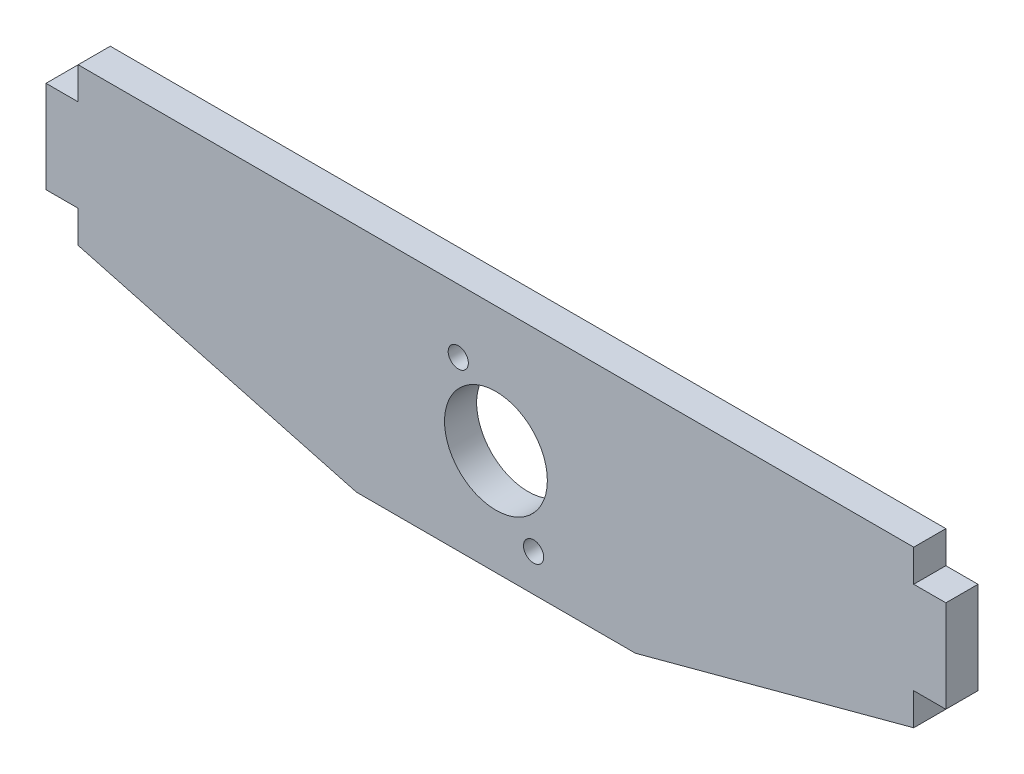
ISO-10303-21;
HEADER;
FILE_DESCRIPTION(('STEP AP214'),'2;1');
FILE_NAME('part.step','',(''),(''),'','','');
FILE_SCHEMA(('AUTOMOTIVE_DESIGN { 1 0 10303 214 1 1 1 1 }'));
ENDSEC;
DATA;
#1=APPLICATION_CONTEXT('core data for automotive mechanical design processes');
#2=APPLICATION_PROTOCOL_DEFINITION('international standard','automotive_design',2000,#1);
#3=PRODUCT_CONTEXT('',#1,'mechanical');
#4=PRODUCT('Part','Part','',(#3));
#5=PRODUCT_RELATED_PRODUCT_CATEGORY('part','',(#4));
#6=PRODUCT_DEFINITION_FORMATION('','',#4);
#7=PRODUCT_DEFINITION_CONTEXT('part definition',#1,'design');
#8=PRODUCT_DEFINITION('design','',#6,#7);
#9=PRODUCT_DEFINITION_SHAPE('','',#8);
#10=(LENGTH_UNIT() NAMED_UNIT(*) SI_UNIT(.MILLI.,.METRE.));
#11=(NAMED_UNIT(*) PLANE_ANGLE_UNIT() SI_UNIT($,.RADIAN.));
#12=(NAMED_UNIT(*) SI_UNIT($,.STERADIAN.) SOLID_ANGLE_UNIT());
#13=UNCERTAINTY_MEASURE_WITH_UNIT(LENGTH_MEASURE(1.E-05),#10,'distance_accuracy_value','');
#14=(GEOMETRIC_REPRESENTATION_CONTEXT(3) GLOBAL_UNCERTAINTY_ASSIGNED_CONTEXT((#13)) GLOBAL_UNIT_ASSIGNED_CONTEXT((#10,
#11,#12)) REPRESENTATION_CONTEXT('',''));
#15=CARTESIAN_POINT('',(0.,0.,0.));
#16=DIRECTION('',(0.,0.,1.));
#17=DIRECTION('',(1.,0.,0.));
#18=AXIS2_PLACEMENT_3D('',#15,#16,#17);
#19=CARTESIAN_POINT('',(44.45,12.7,1.5875));
#20=DIRECTION('',(-1.,0.,0.));
#21=DIRECTION('',(0.,0.,1.));
#22=AXIS2_PLACEMENT_3D('',#19,#20,#21);
#23=PLANE('',#22);
#24=DIRECTION('',(0.,1.,0.));
#25=VECTOR('',#24,1.);
#26=CARTESIAN_POINT('',(44.45,12.7,1.5875));
#27=LINE('',#26,#25);
#28=CARTESIAN_POINT('',(44.45,0.419261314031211,1.5875));
#29=VERTEX_POINT('',#28);
#30=CARTESIAN_POINT('',(44.45,9.52500000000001,1.5875));
#31=VERTEX_POINT('',#30);
#32=EDGE_CURVE('E251',#29,#31,#27,.T.);
#33=ORIENTED_EDGE('',*,*,#32,.F.);
#34=DIRECTION('',(0.,0.,1.));
#35=VECTOR('',#34,1.);
#36=CARTESIAN_POINT('',(44.45,0.419261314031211,-1.5875));
#37=LINE('',#36,#35);
#38=CARTESIAN_POINT('',(44.45,0.419261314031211,-1.5875));
#39=VERTEX_POINT('',#38);
#40=EDGE_CURVE('E156',#39,#29,#37,.T.);
#41=ORIENTED_EDGE('',*,*,#40,.F.);
#42=DIRECTION('',(0.,1.,0.));
#43=VECTOR('',#42,1.);
#44=CARTESIAN_POINT('',(44.45,12.7,-1.5875));
#45=LINE('',#44,#43);
#46=CARTESIAN_POINT('',(44.45,9.52500000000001,-1.5875));
#47=VERTEX_POINT('',#46);
#48=EDGE_CURVE('E151',#39,#47,#45,.T.);
#49=ORIENTED_EDGE('',*,*,#48,.T.);
#50=DIRECTION('',(0.,0.,1.));
#51=VECTOR('',#50,1.);
#52=CARTESIAN_POINT('',(44.45,9.52500000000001,-1.5875));
#53=LINE('',#52,#51);
#54=EDGE_CURVE('E226',#47,#31,#53,.T.);
#55=ORIENTED_EDGE('',*,*,#54,.T.);
#56=EDGE_LOOP('',(#33,#41,#49,#55));
#57=FACE_BOUND('',#56,.T.);
#58=ADVANCED_FACE('F31',(#57),#23,.F.);
#59=CARTESIAN_POINT('',(-44.45,12.7,1.5875));
#60=DIRECTION('',(0.,-1.,0.));
#61=DIRECTION('',(0.,0.,-1.));
#62=AXIS2_PLACEMENT_3D('',#59,#60,#61);
#63=PLANE('',#62);
#64=DIRECTION('',(-1.,0.,0.));
#65=VECTOR('',#64,1.);
#66=CARTESIAN_POINT('',(-44.45,12.7,1.5875));
#67=LINE('',#66,#65);
#68=CARTESIAN_POINT('',(41.275,12.7,1.5875));
#69=VERTEX_POINT('',#68);
#70=CARTESIAN_POINT('',(-41.275,12.7,1.5875));
#71=VERTEX_POINT('',#70);
#72=EDGE_CURVE('E39',#69,#71,#67,.T.);
#73=ORIENTED_EDGE('',*,*,#72,.F.);
#74=DIRECTION('',(0.,0.,1.));
#75=VECTOR('',#74,1.);
#76=CARTESIAN_POINT('',(41.275,12.7,-1.5875));
#77=LINE('',#76,#75);
#78=CARTESIAN_POINT('',(41.275,12.7,-1.5875));
#79=VERTEX_POINT('',#78);
#80=EDGE_CURVE('E221',#79,#69,#77,.T.);
#81=ORIENTED_EDGE('',*,*,#80,.F.);
#82=DIRECTION('',(-1.,0.,0.));
#83=VECTOR('',#82,1.);
#84=CARTESIAN_POINT('',(-44.45,12.7,-1.5875));
#85=LINE('',#84,#83);
#86=CARTESIAN_POINT('',(-41.275,12.7,-1.5875));
#87=VERTEX_POINT('',#86);
#88=EDGE_CURVE('E254',#79,#87,#85,.T.);
#89=ORIENTED_EDGE('',*,*,#88,.T.);
#90=DIRECTION('',(0.,0.,1.));
#91=VECTOR('',#90,1.);
#92=CARTESIAN_POINT('',(-41.275,12.7,-1.5875));
#93=LINE('',#92,#91);
#94=EDGE_CURVE('E245',#87,#71,#93,.T.);
#95=ORIENTED_EDGE('',*,*,#94,.T.);
#96=EDGE_LOOP('',(#73,#81,#89,#95));
#97=FACE_BOUND('',#96,.T.);
#98=ADVANCED_FACE('F286',(#97),#63,.F.);
#99=CARTESIAN_POINT('',(-44.45,12.7,1.5875));
#100=DIRECTION('',(1.,0.,0.));
#101=DIRECTION('',(0.,0.,-1.));
#102=AXIS2_PLACEMENT_3D('',#99,#100,#101);
#103=PLANE('',#102);
#104=DIRECTION('',(0.,-1.,0.));
#105=VECTOR('',#104,1.);
#106=CARTESIAN_POINT('',(-44.45,12.7,-1.5875));
#107=LINE('',#106,#105);
#108=CARTESIAN_POINT('',(-44.45,9.525,-1.5875));
#109=VERTEX_POINT('',#108);
#110=CARTESIAN_POINT('',(-44.45,0.4192613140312,-1.5875));
#111=VERTEX_POINT('',#110);
#112=EDGE_CURVE('E34',#109,#111,#107,.T.);
#113=ORIENTED_EDGE('',*,*,#112,.T.);
#114=DIRECTION('',(0.,0.,1.));
#115=VECTOR('',#114,1.);
#116=CARTESIAN_POINT('',(-44.45,0.4192613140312,-1.5875));
#117=LINE('',#116,#115);
#118=CARTESIAN_POINT('',(-44.45,0.4192613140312,1.5875));
#119=VERTEX_POINT('',#118);
#120=EDGE_CURVE('E169',#111,#119,#117,.T.);
#121=ORIENTED_EDGE('',*,*,#120,.T.);
#122=DIRECTION('',(0.,-1.,0.));
#123=VECTOR('',#122,1.);
#124=CARTESIAN_POINT('',(-44.45,12.7,1.5875));
#125=LINE('',#124,#123);
#126=CARTESIAN_POINT('',(-44.45,9.525,1.5875));
#127=VERTEX_POINT('',#126);
#128=EDGE_CURVE('E11',#127,#119,#125,.T.);
#129=ORIENTED_EDGE('',*,*,#128,.F.);
#130=DIRECTION('',(0.,0.,1.));
#131=VECTOR('',#130,1.);
#132=CARTESIAN_POINT('',(-44.45,9.525,-1.5875));
#133=LINE('',#132,#131);
#134=EDGE_CURVE('E240',#109,#127,#133,.T.);
#135=ORIENTED_EDGE('',*,*,#134,.F.);
#136=EDGE_LOOP('',(#113,#121,#129,#135));
#137=FACE_BOUND('',#136,.T.);
#138=ADVANCED_FACE('F263',(#137),#103,.F.);
#139=CARTESIAN_POINT('',(44.45,-12.7,1.5875));
#140=DIRECTION('',(0.,0.,1.));
#141=DIRECTION('',(1.,0.,0.));
#142=AXIS2_PLACEMENT_3D('',#139,#140,#141);
#143=PLANE('',#142);
#144=DIRECTION('',(-1.,0.,0.));
#145=VECTOR('',#144,1.);
#146=CARTESIAN_POINT('',(41.275,0.419261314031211,1.5875));
#147=LINE('',#146,#145);
#148=CARTESIAN_POINT('',(41.275,0.419261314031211,1.5875));
#149=VERTEX_POINT('',#148);
#150=EDGE_CURVE('E139',#29,#149,#147,.T.);
#151=ORIENTED_EDGE('',*,*,#150,.F.);
#152=ORIENTED_EDGE('',*,*,#32,.T.);
#153=DIRECTION('',(1.,0.,0.));
#154=VECTOR('',#153,1.);
#155=CARTESIAN_POINT('',(44.45,9.52500000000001,1.5875));
#156=LINE('',#155,#154);
#157=CARTESIAN_POINT('',(41.275,9.52500000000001,1.5875));
#158=VERTEX_POINT('',#157);
#159=EDGE_CURVE('E219',#158,#31,#156,.T.);
#160=ORIENTED_EDGE('',*,*,#159,.F.);
#161=DIRECTION('',(0.,-1.,0.));
#162=VECTOR('',#161,1.);
#163=CARTESIAN_POINT('',(41.275,12.7,1.5875));
#164=LINE('',#163,#162);
#165=EDGE_CURVE('E212',#69,#158,#164,.T.);
#166=ORIENTED_EDGE('',*,*,#165,.F.);
#167=ORIENTED_EDGE('',*,*,#72,.T.);
#168=DIRECTION('',(0.,1.,0.));
#169=VECTOR('',#168,1.);
#170=CARTESIAN_POINT('',(-41.275,12.7,1.5875));
#171=LINE('',#170,#169);
#172=CARTESIAN_POINT('',(-41.275,9.525,1.5875));
#173=VERTEX_POINT('',#172);
#174=EDGE_CURVE('E237',#173,#71,#171,.T.);
#175=ORIENTED_EDGE('',*,*,#174,.F.);
#176=DIRECTION('',(1.,0.,0.));
#177=VECTOR('',#176,1.);
#178=CARTESIAN_POINT('',(-44.45,9.525,1.5875));
#179=LINE('',#178,#177);
#180=EDGE_CURVE('E229',#127,#173,#179,.T.);
#181=ORIENTED_EDGE('',*,*,#180,.F.);
#182=ORIENTED_EDGE('',*,*,#128,.T.);
#183=DIRECTION('',(-1.,0.,0.));
#184=VECTOR('',#183,1.);
#185=CARTESIAN_POINT('',(-41.275,0.419261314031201,1.5875));
#186=LINE('',#185,#184);
#187=CARTESIAN_POINT('',(-41.275,0.419261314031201,1.5875));
#188=VERTEX_POINT('',#187);
#189=EDGE_CURVE('E162',#188,#119,#186,.T.);
#190=ORIENTED_EDGE('',*,*,#189,.F.);
#191=DIRECTION('',(0.,1.,0.));
#192=VECTOR('',#191,1.);
#193=CARTESIAN_POINT('',(-41.275,-2.7557386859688,1.5875));
#194=LINE('',#193,#192);
#195=CARTESIAN_POINT('',(-41.275,-2.7557386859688,1.5875));
#196=VERTEX_POINT('',#195);
#197=EDGE_CURVE('E158',#196,#188,#194,.T.);
#198=ORIENTED_EDGE('',*,*,#197,.F.);
#199=DIRECTION('',(-0.96592582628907,0.258819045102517,0.));
#200=VECTOR('',#199,1.);
#201=CARTESIAN_POINT('',(-44.45,-1.905,1.5875));
#202=LINE('',#201,#200);
#203=CARTESIAN_POINT('',(-13.781855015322,-10.1225046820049,1.5875));
#204=VERTEX_POINT('',#203);
#205=EDGE_CURVE('E179',#204,#196,#202,.T.);
#206=ORIENTED_EDGE('',*,*,#205,.F.);
#207=DIRECTION('',(-1.,0.,0.));
#208=VECTOR('',#207,1.);
#209=CARTESIAN_POINT('',(-13.781855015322,-10.1225046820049,1.5875));
#210=LINE('',#209,#208);
#211=CARTESIAN_POINT('',(13.7818550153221,-10.1225046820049,1.5875));
#212=VERTEX_POINT('',#211);
#213=EDGE_CURVE('E187',#212,#204,#210,.T.);
#214=ORIENTED_EDGE('',*,*,#213,.F.);
#215=DIRECTION('',(-0.965925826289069,-0.258819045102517,0.));
#216=VECTOR('',#215,1.);
#217=CARTESIAN_POINT('',(44.45,-1.90499999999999,1.5875));
#218=LINE('',#217,#216);
#219=CARTESIAN_POINT('',(41.275,-2.75573868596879,1.5875));
#220=VERTEX_POINT('',#219);
#221=EDGE_CURVE('E172',#220,#212,#218,.T.);
#222=ORIENTED_EDGE('',*,*,#221,.F.);
#223=DIRECTION('',(0.,-1.,0.));
#224=VECTOR('',#223,1.);
#225=CARTESIAN_POINT('',(41.275,-2.7557386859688,1.5875));
#226=LINE('',#225,#224);
#227=EDGE_CURVE('E47',#149,#220,#226,.T.);
#228=ORIENTED_EDGE('',*,*,#227,.F.);
#229=EDGE_LOOP('',(#151,#152,#160,#166,#167,#175,#181,#182,#190,#198,#206,#214,#222,#228));
#230=FACE_BOUND('',#229,.T.);
#231=CARTESIAN_POINT('',(-3.72109999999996,6.44513426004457,1.5875));
#232=DIRECTION('',(0.,0.,1.));
#233=DIRECTION('',(1.,0.,0.));
#234=AXIS2_PLACEMENT_3D('',#231,#232,#233);
#235=CIRCLE('',#234,0.996949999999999);
#236=CARTESIAN_POINT('',(-2.72414999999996,6.44513426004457,1.5875));
#237=VERTEX_POINT('',#236);
#238=EDGE_CURVE('E194',#237,#237,#235,.T.);
#239=ORIENTED_EDGE('',*,*,#238,.F.);
#240=EDGE_LOOP('',(#239));
#241=FACE_BOUND('',#240,.T.);
#242=CARTESIAN_POINT('',(3.72109999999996,-6.44513426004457,1.5875));
#243=DIRECTION('',(0.,0.,1.));
#244=DIRECTION('',(1.,0.,0.));
#245=AXIS2_PLACEMENT_3D('',#242,#243,#244);
#246=CIRCLE('',#245,0.99695);
#247=CARTESIAN_POINT('',(4.71804999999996,-6.44513426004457,1.5875));
#248=VERTEX_POINT('',#247);
#249=EDGE_CURVE('E202',#248,#248,#246,.T.);
#250=ORIENTED_EDGE('',*,*,#249,.F.);
#251=EDGE_LOOP('',(#250));
#252=FACE_BOUND('',#251,.T.);
#253=CARTESIAN_POINT('',(0.,0.30480000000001,1.5875));
#254=DIRECTION('',(0.,0.,1.));
#255=DIRECTION('',(1.,0.,0.));
#256=AXIS2_PLACEMENT_3D('',#253,#254,#255);
#257=CIRCLE('',#256,5.08);
#258=CARTESIAN_POINT('',(5.08,0.30480000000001,1.5875));
#259=VERTEX_POINT('',#258);
#260=EDGE_CURVE('E208',#259,#259,#257,.T.);
#261=ORIENTED_EDGE('',*,*,#260,.F.);
#262=EDGE_LOOP('',(#261));
#263=FACE_BOUND('',#262,.T.);
#264=ADVANCED_FACE('F271',(#230,#241,#252,#263),#143,.T.);
#265=CARTESIAN_POINT('',(44.45,-12.7,-1.5875));
#266=DIRECTION('',(0.,0.,1.));
#267=DIRECTION('',(1.,0.,0.));
#268=AXIS2_PLACEMENT_3D('',#265,#266,#267);
#269=PLANE('',#268);
#270=CARTESIAN_POINT('',(-3.72109999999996,6.44513426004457,-1.5875));
#271=DIRECTION('',(0.,0.,1.));
#272=DIRECTION('',(1.,0.,0.));
#273=AXIS2_PLACEMENT_3D('',#270,#271,#272);
#274=CIRCLE('',#273,0.996949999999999);
#275=CARTESIAN_POINT('',(-2.72414999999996,6.44513426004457,-1.5875));
#276=VERTEX_POINT('',#275);
#277=EDGE_CURVE('E199',#276,#276,#274,.T.);
#278=ORIENTED_EDGE('',*,*,#277,.T.);
#279=EDGE_LOOP('',(#278));
#280=FACE_BOUND('',#279,.T.);
#281=CARTESIAN_POINT('',(3.72109999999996,-6.44513426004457,-1.5875));
#282=DIRECTION('',(0.,0.,1.));
#283=DIRECTION('',(1.,0.,0.));
#284=AXIS2_PLACEMENT_3D('',#281,#282,#283);
#285=CIRCLE('',#284,0.996949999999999);
#286=CARTESIAN_POINT('',(4.71804999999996,-6.44513426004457,-1.5875));
#287=VERTEX_POINT('',#286);
#288=EDGE_CURVE('E205',#287,#287,#285,.T.);
#289=ORIENTED_EDGE('',*,*,#288,.T.);
#290=EDGE_LOOP('',(#289));
#291=FACE_BOUND('',#290,.T.);
#292=CARTESIAN_POINT('',(0.,0.30480000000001,-1.5875));
#293=DIRECTION('',(0.,0.,1.));
#294=DIRECTION('',(1.,0.,0.));
#295=AXIS2_PLACEMENT_3D('',#292,#293,#294);
#296=CIRCLE('',#295,5.08);
#297=CARTESIAN_POINT('',(5.08,0.30480000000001,-1.5875));
#298=VERTEX_POINT('',#297);
#299=EDGE_CURVE('E209',#298,#298,#296,.T.);
#300=ORIENTED_EDGE('',*,*,#299,.T.);
#301=EDGE_LOOP('',(#300));
#302=FACE_BOUND('',#301,.T.);
#303=ORIENTED_EDGE('',*,*,#48,.F.);
#304=DIRECTION('',(-1.,0.,0.));
#305=VECTOR('',#304,1.);
#306=CARTESIAN_POINT('',(41.275,0.419261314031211,-1.5875));
#307=LINE('',#306,#305);
#308=CARTESIAN_POINT('',(41.275,0.419261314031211,-1.5875));
#309=VERTEX_POINT('',#308);
#310=EDGE_CURVE('E136',#39,#309,#307,.T.);
#311=ORIENTED_EDGE('',*,*,#310,.T.);
#312=DIRECTION('',(0.,-1.,0.));
#313=VECTOR('',#312,1.);
#314=CARTESIAN_POINT('',(41.275,-2.7557386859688,-1.5875));
#315=LINE('',#314,#313);
#316=CARTESIAN_POINT('',(41.275,-2.7557386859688,-1.5875));
#317=VERTEX_POINT('',#316);
#318=EDGE_CURVE('E141',#309,#317,#315,.T.);
#319=ORIENTED_EDGE('',*,*,#318,.T.);
#320=DIRECTION('',(-0.965925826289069,-0.258819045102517,0.));
#321=VECTOR('',#320,1.);
#322=CARTESIAN_POINT('',(44.45,-1.90499999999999,-1.5875));
#323=LINE('',#322,#321);
#324=CARTESIAN_POINT('',(13.7818550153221,-10.1225046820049,-1.5875));
#325=VERTEX_POINT('',#324);
#326=EDGE_CURVE('E176',#317,#325,#323,.T.);
#327=ORIENTED_EDGE('',*,*,#326,.T.);
#328=DIRECTION('',(-1.,0.,0.));
#329=VECTOR('',#328,1.);
#330=CARTESIAN_POINT('',(-13.781855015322,-10.1225046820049,-1.5875));
#331=LINE('',#330,#329);
#332=CARTESIAN_POINT('',(-13.781855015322,-10.1225046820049,-1.5875));
#333=VERTEX_POINT('',#332);
#334=EDGE_CURVE('E178',#325,#333,#331,.T.);
#335=ORIENTED_EDGE('',*,*,#334,.T.);
#336=DIRECTION('',(-0.96592582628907,0.258819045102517,0.));
#337=VECTOR('',#336,1.);
#338=CARTESIAN_POINT('',(-44.45,-1.905,-1.5875));
#339=LINE('',#338,#337);
#340=CARTESIAN_POINT('',(-41.275,-2.7557386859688,-1.5875));
#341=VERTEX_POINT('',#340);
#342=EDGE_CURVE('E182',#333,#341,#339,.T.);
#343=ORIENTED_EDGE('',*,*,#342,.T.);
#344=DIRECTION('',(0.,1.,0.));
#345=VECTOR('',#344,1.);
#346=CARTESIAN_POINT('',(-41.275,-2.7557386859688,-1.5875));
#347=LINE('',#346,#345);
#348=CARTESIAN_POINT('',(-41.275,0.419261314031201,-1.5875));
#349=VERTEX_POINT('',#348);
#350=EDGE_CURVE('E55',#341,#349,#347,.T.);
#351=ORIENTED_EDGE('',*,*,#350,.T.);
#352=DIRECTION('',(-1.,0.,0.));
#353=VECTOR('',#352,1.);
#354=CARTESIAN_POINT('',(-41.275,0.419261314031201,-1.5875));
#355=LINE('',#354,#353);
#356=EDGE_CURVE('E161',#349,#111,#355,.T.);
#357=ORIENTED_EDGE('',*,*,#356,.T.);
#358=ORIENTED_EDGE('',*,*,#112,.F.);
#359=DIRECTION('',(1.,0.,0.));
#360=VECTOR('',#359,1.);
#361=CARTESIAN_POINT('',(-44.45,9.525,-1.5875));
#362=LINE('',#361,#360);
#363=CARTESIAN_POINT('',(-41.275,9.525,-1.5875));
#364=VERTEX_POINT('',#363);
#365=EDGE_CURVE('E233',#109,#364,#362,.T.);
#366=ORIENTED_EDGE('',*,*,#365,.T.);
#367=DIRECTION('',(0.,1.,0.));
#368=VECTOR('',#367,1.);
#369=CARTESIAN_POINT('',(-41.275,12.7,-1.5875));
#370=LINE('',#369,#368);
#371=EDGE_CURVE('E236',#364,#87,#370,.T.);
#372=ORIENTED_EDGE('',*,*,#371,.T.);
#373=ORIENTED_EDGE('',*,*,#88,.F.);
#374=DIRECTION('',(0.,-1.,0.));
#375=VECTOR('',#374,1.);
#376=CARTESIAN_POINT('',(41.275,12.7,-1.5875));
#377=LINE('',#376,#375);
#378=CARTESIAN_POINT('',(41.275,9.52500000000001,-1.5875));
#379=VERTEX_POINT('',#378);
#380=EDGE_CURVE('E215',#79,#379,#377,.T.);
#381=ORIENTED_EDGE('',*,*,#380,.T.);
#382=DIRECTION('',(1.,0.,0.));
#383=VECTOR('',#382,1.);
#384=CARTESIAN_POINT('',(44.45,9.52500000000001,-1.5875));
#385=LINE('',#384,#383);
#386=EDGE_CURVE('E218',#379,#47,#385,.T.);
#387=ORIENTED_EDGE('',*,*,#386,.T.);
#388=EDGE_LOOP('',(#303,#311,#319,#327,#335,#343,#351,#357,#358,#366,#372,#373,#381,#387));
#389=FACE_BOUND('',#388,.T.);
#390=ADVANCED_FACE('F149',(#280,#291,#302,#389),#269,.F.);
#391=CARTESIAN_POINT('',(-41.275,12.7,-1.5875));
#392=DIRECTION('',(1.,0.,0.));
#393=DIRECTION('',(0.,0.,-1.));
#394=AXIS2_PLACEMENT_3D('',#391,#392,#393);
#395=PLANE('',#394);
#396=ORIENTED_EDGE('',*,*,#174,.T.);
#397=ORIENTED_EDGE('',*,*,#94,.F.);
#398=ORIENTED_EDGE('',*,*,#371,.F.);
#399=DIRECTION('',(0.,0.,1.));
#400=VECTOR('',#399,1.);
#401=CARTESIAN_POINT('',(-41.275,9.525,-1.5875));
#402=LINE('',#401,#400);
#403=EDGE_CURVE('E248',#364,#173,#402,.T.);
#404=ORIENTED_EDGE('',*,*,#403,.T.);
#405=EDGE_LOOP('',(#396,#397,#398,#404));
#406=FACE_BOUND('',#405,.T.);
#407=ADVANCED_FACE('F280',(#406),#395,.F.);
#408=CARTESIAN_POINT('',(-44.45,9.525,-1.5875));
#409=DIRECTION('',(0.,-1.,0.));
#410=DIRECTION('',(0.,0.,-1.));
#411=AXIS2_PLACEMENT_3D('',#408,#409,#410);
#412=PLANE('',#411);
#413=ORIENTED_EDGE('',*,*,#180,.T.);
#414=ORIENTED_EDGE('',*,*,#403,.F.);
#415=ORIENTED_EDGE('',*,*,#365,.F.);
#416=ORIENTED_EDGE('',*,*,#134,.T.);
#417=EDGE_LOOP('',(#413,#414,#415,#416));
#418=FACE_BOUND('',#417,.T.);
#419=ADVANCED_FACE('F278',(#418),#412,.F.);
#420=CARTESIAN_POINT('',(44.45,9.52500000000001,-1.5875));
#421=DIRECTION('',(0.,-1.,0.));
#422=DIRECTION('',(0.,0.,-1.));
#423=AXIS2_PLACEMENT_3D('',#420,#421,#422);
#424=PLANE('',#423);
#425=ORIENTED_EDGE('',*,*,#159,.T.);
#426=ORIENTED_EDGE('',*,*,#54,.F.);
#427=ORIENTED_EDGE('',*,*,#386,.F.);
#428=DIRECTION('',(0.,0.,1.));
#429=VECTOR('',#428,1.);
#430=CARTESIAN_POINT('',(41.275,9.52500000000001,-1.5875));
#431=LINE('',#430,#429);
#432=EDGE_CURVE('E230',#379,#158,#431,.T.);
#433=ORIENTED_EDGE('',*,*,#432,.T.);
#434=EDGE_LOOP('',(#425,#426,#427,#433));
#435=FACE_BOUND('',#434,.T.);
#436=ADVANCED_FACE('F291',(#435),#424,.F.);
#437=CARTESIAN_POINT('',(41.275,12.7,-1.5875));
#438=DIRECTION('',(-1.,0.,0.));
#439=DIRECTION('',(0.,0.,1.));
#440=AXIS2_PLACEMENT_3D('',#437,#438,#439);
#441=PLANE('',#440);
#442=ORIENTED_EDGE('',*,*,#165,.T.);
#443=ORIENTED_EDGE('',*,*,#432,.F.);
#444=ORIENTED_EDGE('',*,*,#380,.F.);
#445=ORIENTED_EDGE('',*,*,#80,.T.);
#446=EDGE_LOOP('',(#442,#443,#444,#445));
#447=FACE_BOUND('',#446,.T.);
#448=ADVANCED_FACE('F283',(#447),#441,.F.);
#449=CARTESIAN_POINT('',(0.,0.30480000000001,-1.5875));
#450=DIRECTION('',(0.,0.,1.));
#451=DIRECTION('',(1.,0.,0.));
#452=AXIS2_PLACEMENT_3D('',#449,#450,#451);
#453=CYLINDRICAL_SURFACE('',#452,5.08);
#454=ORIENTED_EDGE('',*,*,#299,.F.);
#455=EDGE_LOOP('',(#454));
#456=FACE_BOUND('',#455,.T.);
#457=ORIENTED_EDGE('',*,*,#260,.T.);
#458=EDGE_LOOP('',(#457));
#459=FACE_BOUND('',#458,.T.);
#460=ADVANCED_FACE('F334',(#456,#459),#453,.F.);
#461=CARTESIAN_POINT('',(3.72109999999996,-6.44513426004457,1.5875));
#462=DIRECTION('',(0.,0.,1.));
#463=DIRECTION('',(1.,0.,0.));
#464=AXIS2_PLACEMENT_3D('',#461,#462,#463);
#465=CYLINDRICAL_SURFACE('',#464,0.996949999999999);
#466=ORIENTED_EDGE('',*,*,#288,.F.);
#467=EDGE_LOOP('',(#466));
#468=FACE_BOUND('',#467,.T.);
#469=ORIENTED_EDGE('',*,*,#249,.T.);
#470=EDGE_LOOP('',(#469));
#471=FACE_BOUND('',#470,.T.);
#472=ADVANCED_FACE('F339',(#468,#471),#465,.F.);
#473=CARTESIAN_POINT('',(-3.72109999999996,6.44513426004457,1.5875));
#474=DIRECTION('',(0.,0.,1.));
#475=DIRECTION('',(1.,0.,0.));
#476=AXIS2_PLACEMENT_3D('',#473,#474,#475);
#477=CYLINDRICAL_SURFACE('',#476,0.996949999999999);
#478=ORIENTED_EDGE('',*,*,#277,.F.);
#479=EDGE_LOOP('',(#478));
#480=FACE_BOUND('',#479,.T.);
#481=ORIENTED_EDGE('',*,*,#238,.T.);
#482=EDGE_LOOP('',(#481));
#483=FACE_BOUND('',#482,.T.);
#484=ADVANCED_FACE('F343',(#480,#483),#477,.F.);
#485=CARTESIAN_POINT('',(-44.45,-1.905,-1.5875));
#486=DIRECTION('',(0.258819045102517,0.965925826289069,0.));
#487=DIRECTION('',(-0.965925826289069,0.258819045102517,0.));
#488=AXIS2_PLACEMENT_3D('',#485,#486,#487);
#489=PLANE('',#488);
#490=ORIENTED_EDGE('',*,*,#205,.T.);
#491=DIRECTION('',(0.,0.,1.));
#492=VECTOR('',#491,1.);
#493=CARTESIAN_POINT('',(-41.275,-2.7557386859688,-1.5875));
#494=LINE('',#493,#492);
#495=EDGE_CURVE('E165',#341,#196,#494,.T.);
#496=ORIENTED_EDGE('',*,*,#495,.F.);
#497=ORIENTED_EDGE('',*,*,#342,.F.);
#498=DIRECTION('',(0.,0.,1.));
#499=VECTOR('',#498,1.);
#500=CARTESIAN_POINT('',(-13.781855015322,-10.1225046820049,-1.5875));
#501=LINE('',#500,#499);
#502=EDGE_CURVE('E192',#333,#204,#501,.T.);
#503=ORIENTED_EDGE('',*,*,#502,.T.);
#504=EDGE_LOOP('',(#490,#496,#497,#503));
#505=FACE_BOUND('',#504,.T.);
#506=ADVANCED_FACE('F303',(#505),#489,.F.);
#507=CARTESIAN_POINT('',(-13.781855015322,-10.1225046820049,-1.5875));
#508=DIRECTION('',(0.,1.,0.));
#509=DIRECTION('',(0.,0.,1.));
#510=AXIS2_PLACEMENT_3D('',#507,#508,#509);
#511=PLANE('',#510);
#512=ORIENTED_EDGE('',*,*,#213,.T.);
#513=ORIENTED_EDGE('',*,*,#502,.F.);
#514=ORIENTED_EDGE('',*,*,#334,.F.);
#515=DIRECTION('',(0.,0.,1.));
#516=VECTOR('',#515,1.);
#517=CARTESIAN_POINT('',(13.7818550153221,-10.1225046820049,-1.5875));
#518=LINE('',#517,#516);
#519=EDGE_CURVE('E185',#325,#212,#518,.T.);
#520=ORIENTED_EDGE('',*,*,#519,.T.);
#521=EDGE_LOOP('',(#512,#513,#514,#520));
#522=FACE_BOUND('',#521,.T.);
#523=ADVANCED_FACE('F300',(#522),#511,.F.);
#524=CARTESIAN_POINT('',(44.45,-1.90499999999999,-1.5875));
#525=DIRECTION('',(-0.258819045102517,0.965925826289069,0.));
#526=DIRECTION('',(-0.965925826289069,-0.258819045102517,0.));
#527=AXIS2_PLACEMENT_3D('',#524,#525,#526);
#528=PLANE('',#527);
#529=ORIENTED_EDGE('',*,*,#326,.F.);
#530=DIRECTION('',(0.,0.,1.));
#531=VECTOR('',#530,1.);
#532=CARTESIAN_POINT('',(41.275,-2.7557386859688,-1.5875));
#533=LINE('',#532,#531);
#534=EDGE_CURVE('E140',#317,#220,#533,.T.);
#535=ORIENTED_EDGE('',*,*,#534,.T.);
#536=ORIENTED_EDGE('',*,*,#221,.T.);
#537=ORIENTED_EDGE('',*,*,#519,.F.);
#538=EDGE_LOOP('',(#529,#535,#536,#537));
#539=FACE_BOUND('',#538,.T.);
#540=ADVANCED_FACE('F297',(#539),#528,.F.);
#541=CARTESIAN_POINT('',(-41.275,0.419261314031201,-1.5875));
#542=DIRECTION('',(0.,1.,0.));
#543=DIRECTION('',(-1.,0.,0.));
#544=AXIS2_PLACEMENT_3D('',#541,#542,#543);
#545=PLANE('',#544);
#546=ORIENTED_EDGE('',*,*,#189,.T.);
#547=ORIENTED_EDGE('',*,*,#120,.F.);
#548=ORIENTED_EDGE('',*,*,#356,.F.);
#549=DIRECTION('',(0.,0.,1.));
#550=VECTOR('',#549,1.);
#551=CARTESIAN_POINT('',(-41.275,0.419261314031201,-1.5875));
#552=LINE('',#551,#550);
#553=EDGE_CURVE('E173',#349,#188,#552,.T.);
#554=ORIENTED_EDGE('',*,*,#553,.T.);
#555=EDGE_LOOP('',(#546,#547,#548,#554));
#556=FACE_BOUND('',#555,.T.);
#557=ADVANCED_FACE('F267',(#556),#545,.F.);
#558=CARTESIAN_POINT('',(-41.275,-2.7557386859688,-1.5875));
#559=DIRECTION('',(1.,0.,0.));
#560=DIRECTION('',(0.,0.,-1.));
#561=AXIS2_PLACEMENT_3D('',#558,#559,#560);
#562=PLANE('',#561);
#563=ORIENTED_EDGE('',*,*,#197,.T.);
#564=ORIENTED_EDGE('',*,*,#553,.F.);
#565=ORIENTED_EDGE('',*,*,#350,.F.);
#566=ORIENTED_EDGE('',*,*,#495,.T.);
#567=EDGE_LOOP('',(#563,#564,#565,#566));
#568=FACE_BOUND('',#567,.T.);
#569=ADVANCED_FACE('F304',(#568),#562,.F.);
#570=CARTESIAN_POINT('',(41.275,0.419261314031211,-1.5875));
#571=DIRECTION('',(0.,1.,0.));
#572=DIRECTION('',(-1.,0.,0.));
#573=AXIS2_PLACEMENT_3D('',#570,#571,#572);
#574=PLANE('',#573);
#575=ORIENTED_EDGE('',*,*,#150,.T.);
#576=DIRECTION('',(0.,0.,1.));
#577=VECTOR('',#576,1.);
#578=CARTESIAN_POINT('',(41.275,0.419261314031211,-1.5875));
#579=LINE('',#578,#577);
#580=EDGE_CURVE('E132',#309,#149,#579,.T.);
#581=ORIENTED_EDGE('',*,*,#580,.F.);
#582=ORIENTED_EDGE('',*,*,#310,.F.);
#583=ORIENTED_EDGE('',*,*,#40,.T.);
#584=EDGE_LOOP('',(#575,#581,#582,#583));
#585=FACE_BOUND('',#584,.T.);
#586=ADVANCED_FACE('F134',(#585),#574,.F.);
#587=CARTESIAN_POINT('',(41.275,-2.7557386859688,-1.5875));
#588=DIRECTION('',(-1.,0.,0.));
#589=DIRECTION('',(0.,0.,1.));
#590=AXIS2_PLACEMENT_3D('',#587,#588,#589);
#591=PLANE('',#590);
#592=ORIENTED_EDGE('',*,*,#227,.T.);
#593=ORIENTED_EDGE('',*,*,#534,.F.);
#594=ORIENTED_EDGE('',*,*,#318,.F.);
#595=ORIENTED_EDGE('',*,*,#580,.T.);
#596=EDGE_LOOP('',(#592,#593,#594,#595));
#597=FACE_BOUND('',#596,.T.);
#598=ADVANCED_FACE('F144',(#597),#591,.F.);
#599=CLOSED_SHELL('',(#58,#98,#138,#264,#390,#407,#419,#436,#448,#460,#472,#484,#506,#523,#540,
#557,#569,#586,#598));
#600=MANIFOLD_SOLID_BREP('B2',#599);
#601=ADVANCED_BREP_SHAPE_REPRESENTATION('',(#18,#600),#14);
#602=SHAPE_DEFINITION_REPRESENTATION(#9,#601);
ENDSEC;
END-ISO-10303-21;
